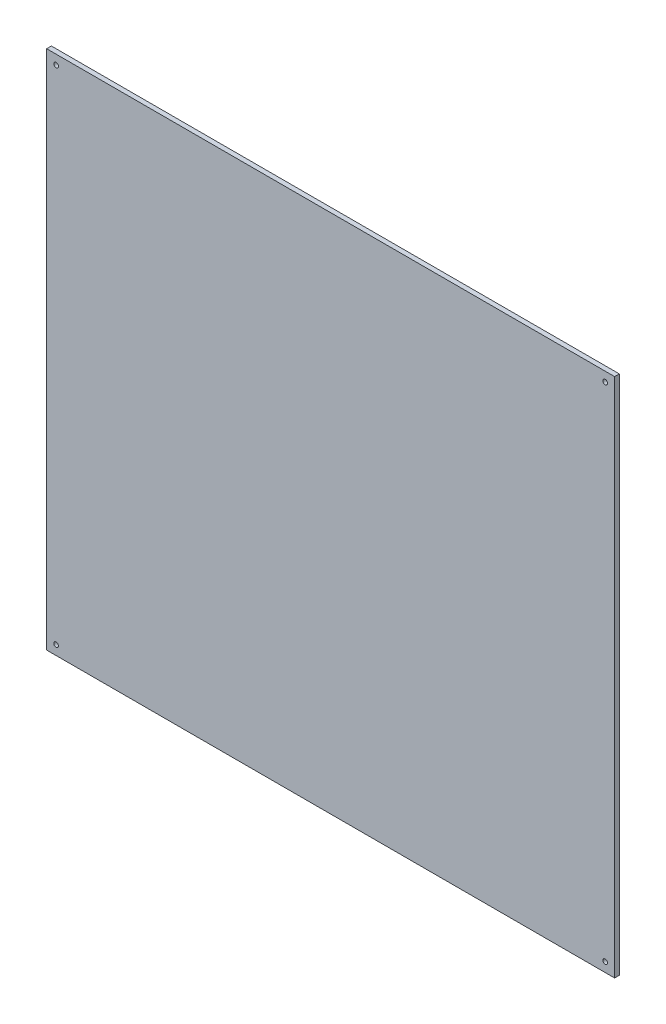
from build123d import *

# Parameters (mm, degrees)
SKETCH1_W           = 362
SKETCH1_H           = 332
SKETCH1_R           = 1.5
BOSS_EXTRUDE1_DEPTH = 3


with BuildPart() as part:
    # Sketch1 → Boss-Extrude1 (new body)
    with BuildSketch(Plane.XY):
        with Locations((181, 166)):
            Rectangle(SKETCH1_W, SKETCH1_H)
        with Locations((356, 326)):
            Circle(SKETCH1_R, mode=Mode.SUBTRACT)
        with Locations(Location((6, 326, 0), (0, 0, 180))):
            Circle(SKETCH1_R, mode=Mode.SUBTRACT)
        with Locations((6, 6)):
            Circle(SKETCH1_R, mode=Mode.SUBTRACT)
        with Locations(Location((356, 6, 0), (0, 0, 180))):
            Circle(SKETCH1_R, mode=Mode.SUBTRACT)
    extrude(amount=BOSS_EXTRUDE1_DEPTH)


solid = part.part
